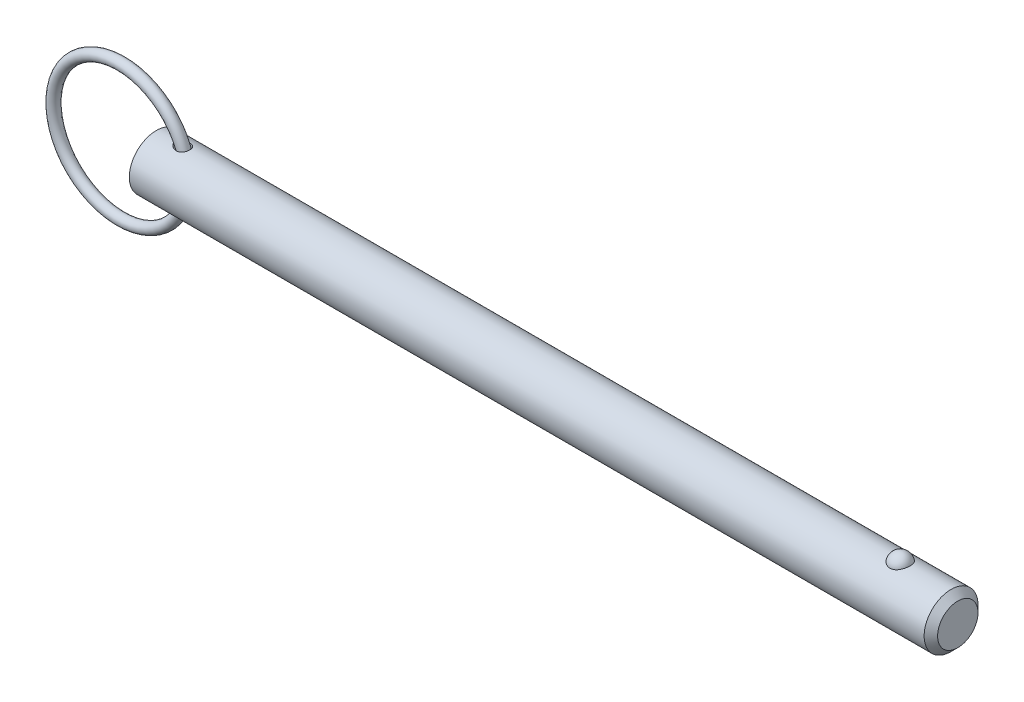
ISO-10303-21;
HEADER;
FILE_DESCRIPTION(('STEP AP214'),'2;1');
FILE_NAME('part.step','',(''),(''),'','','');
FILE_SCHEMA(('AUTOMOTIVE_DESIGN { 1 0 10303 214 1 1 1 1 }'));
ENDSEC;
DATA;
#1=APPLICATION_CONTEXT('core data for automotive mechanical design processes');
#2=APPLICATION_PROTOCOL_DEFINITION('international standard','automotive_design',2000,#1);
#3=PRODUCT_CONTEXT('',#1,'mechanical');
#4=PRODUCT('Part','Part','',(#3));
#5=PRODUCT_RELATED_PRODUCT_CATEGORY('part','',(#4));
#6=PRODUCT_DEFINITION_FORMATION('','',#4);
#7=PRODUCT_DEFINITION_CONTEXT('part definition',#1,'design');
#8=PRODUCT_DEFINITION('design','',#6,#7);
#9=PRODUCT_DEFINITION_SHAPE('','',#8);
#10=(LENGTH_UNIT() NAMED_UNIT(*) SI_UNIT(.MILLI.,.METRE.));
#11=(NAMED_UNIT(*) PLANE_ANGLE_UNIT() SI_UNIT($,.RADIAN.));
#12=(NAMED_UNIT(*) SI_UNIT($,.STERADIAN.) SOLID_ANGLE_UNIT());
#13=UNCERTAINTY_MEASURE_WITH_UNIT(LENGTH_MEASURE(1.E-05),#10,'distance_accuracy_value','');
#14=(GEOMETRIC_REPRESENTATION_CONTEXT(3) GLOBAL_UNCERTAINTY_ASSIGNED_CONTEXT((#13)) GLOBAL_UNIT_ASSIGNED_CONTEXT((#10,
#11,#12)) REPRESENTATION_CONTEXT('',''));
#15=CARTESIAN_POINT('',(0.,0.,0.));
#16=DIRECTION('',(0.,0.,1.));
#17=DIRECTION('',(1.,0.,0.));
#18=AXIS2_PLACEMENT_3D('',#15,#16,#17);
#19=CARTESIAN_POINT('',(-8.34703434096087,0.,0.));
#20=DIRECTION('',(0.,0.,1.));
#21=DIRECTION('',(1.,0.,0.));
#22=AXIS2_PLACEMENT_3D('',#19,#20,#21);
#23=TOROIDAL_SURFACE('',#22,15.875,1.27);
#24=CARTESIAN_POINT('',(8.79796565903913,0.,0.));
#25=VERTEX_POINT('',#24);
#26=VERTEX_LOOP('',#25);
#27=FACE_BOUND('',#26,.T.);
#28=ADVANCED_FACE('P0_F12',(#27),#23,.T.);
#29=CLOSED_SHELL('',(#28));
#30=MANIFOLD_SOLID_BREP('P0_B1',#29);
#31=CARTESIAN_POINT('',(0.,0.,0.));
#32=DIRECTION('',(1.,0.,0.));
#33=DIRECTION('',(0.,0.,-1.));
#34=AXIS2_PLACEMENT_3D('',#31,#32,#33);
#35=CYLINDRICAL_SURFACE('',#34,6.35);
#36=CARTESIAN_POINT('',(4.87230670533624,6.27273159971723,-0.987592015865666));
#37=CARTESIAN_POINT('',(4.94734735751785,6.26035058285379,-1.06623378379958));
#38=CARTESIAN_POINT('',(5.02968768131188,6.24755813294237,-1.13788608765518));
#39=CARTESIAN_POINT('',(5.20534267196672,6.22278258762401,-1.26640223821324));
#40=CARTESIAN_POINT('',(5.29867273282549,6.21080066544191,-1.32324497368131));
#41=CARTESIAN_POINT('',(5.49318962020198,6.18912414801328,-1.42117930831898));
#42=CARTESIAN_POINT('',(5.59435470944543,6.17942350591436,-1.46231273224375));
#43=CARTESIAN_POINT('',(5.80219659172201,6.16352555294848,-1.52793951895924));
#44=CARTESIAN_POINT('',(5.90887152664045,6.15732706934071,-1.55243845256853));
#45=CARTESIAN_POINT('',(6.12818220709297,6.14931784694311,-1.58387975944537));
#46=CARTESIAN_POINT('',(6.24090110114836,6.14763959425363,-1.59029227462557));
#47=CARTESIAN_POINT('',(6.46560233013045,6.14965588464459,-1.58248630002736));
#48=CARTESIAN_POINT('',(6.57758514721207,6.15334646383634,-1.56828303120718));
#49=CARTESIAN_POINT('',(6.78516594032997,6.1652116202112,-1.52091398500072));
#50=CARTESIAN_POINT('',(6.88126802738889,6.17288876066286,-1.48983713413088));
#51=CARTESIAN_POINT('',(7.06576629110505,6.19149190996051,-1.41052329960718));
#52=CARTESIAN_POINT('',(7.15416739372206,6.20241582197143,-1.36229738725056));
#53=CARTESIAN_POINT('',(7.3116692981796,6.2248616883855,-1.25548983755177));
#54=CARTESIAN_POINT('',(7.38181442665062,6.23621734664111,-1.19840625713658));
#55=CARTESIAN_POINT('',(7.51101296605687,6.259037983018,-1.07284763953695));
#56=CARTESIAN_POINT('',(7.5700684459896,6.2705029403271,-1.00437473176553));
#57=CARTESIAN_POINT('',(7.67374693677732,6.29184873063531,-0.860384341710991));
#58=CARTESIAN_POINT('',(7.71876694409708,6.30176816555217,-0.785157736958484));
#59=CARTESIAN_POINT('',(7.79574491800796,6.31935829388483,-0.628053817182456));
#60=CARTESIAN_POINT('',(7.82770308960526,6.32702902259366,-0.546176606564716));
#61=CARTESIAN_POINT('',(7.87788845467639,6.33930929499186,-0.377876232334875));
#62=CARTESIAN_POINT('',(7.8960810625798,6.34391112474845,-0.291442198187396));
#63=CARTESIAN_POINT('',(7.91820729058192,6.34953044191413,-0.116652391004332));
#64=CARTESIAN_POINT('',(7.92214044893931,6.35054781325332,-0.0282965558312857));
#65=CARTESIAN_POINT('',(7.91564686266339,6.34888556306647,0.14826357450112));
#66=CARTESIAN_POINT('',(7.9051533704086,6.34618875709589,0.236465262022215));
#67=CARTESIAN_POINT('',(7.86991530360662,6.33735741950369,0.409798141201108));
#68=CARTESIAN_POINT('',(7.84517062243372,6.33122286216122,0.494929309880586));
#69=CARTESIAN_POINT('',(7.78199851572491,6.31618517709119,0.659657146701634));
#70=CARTESIAN_POINT('',(7.74357645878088,6.30728313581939,0.739255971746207));
#71=CARTESIAN_POINT('',(7.65396632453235,6.28769050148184,0.890663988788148));
#72=CARTESIAN_POINT('',(7.60277911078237,6.27700002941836,0.962473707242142));
#73=CARTESIAN_POINT('',(7.48925881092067,6.2550822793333,1.09590260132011));
#74=CARTESIAN_POINT('',(7.42698604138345,6.24385813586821,1.15757361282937));
#75=CARTESIAN_POINT('',(7.29283556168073,6.2220655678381,1.26951234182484));
#76=CARTESIAN_POINT('',(7.22095880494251,6.21149707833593,1.31978118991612));
#77=CARTESIAN_POINT('',(7.06971853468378,6.19216002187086,1.40772509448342));
#78=CARTESIAN_POINT('',(6.99035873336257,6.18339056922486,1.44540635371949));
#79=CARTESIAN_POINT('',(6.826427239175,6.16851603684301,1.50762653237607));
#80=CARTESIAN_POINT('',(6.74185489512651,6.16241129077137,1.53216380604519));
#81=CARTESIAN_POINT('',(6.56686412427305,6.15321474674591,1.56869994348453));
#82=CARTESIAN_POINT('',(6.47634467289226,6.15023369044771,1.58023897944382));
#83=CARTESIAN_POINT('',(6.29456956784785,6.14778331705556,1.58974172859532));
#84=CARTESIAN_POINT('',(6.20331368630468,6.1483151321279,1.58770106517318));
#85=CARTESIAN_POINT('',(6.01385969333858,6.15284811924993,1.5700487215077));
#86=CARTESIAN_POINT('',(5.91578322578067,6.15715979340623,1.55322212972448));
#87=CARTESIAN_POINT('',(5.72331909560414,6.16902415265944,1.5054032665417));
#88=CARTESIAN_POINT('',(5.62893440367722,6.17657939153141,1.4743998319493));
#89=CARTESIAN_POINT('',(5.43572606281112,6.19502494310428,1.39499475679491));
#90=CARTESIAN_POINT('',(5.33755891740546,6.20619097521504,1.3450526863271));
#91=CARTESIAN_POINT('',(5.15090047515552,6.23006191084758,1.22975103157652));
#92=CARTESIAN_POINT('',(5.06240741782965,6.24276653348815,1.16439425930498));
#93=CARTESIAN_POINT('',(4.91171642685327,6.26607433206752,1.03083814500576));
#94=CARTESIAN_POINT('',(4.84758224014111,6.27668356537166,0.964825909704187));
#95=CARTESIAN_POINT('',(4.73090054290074,6.29683133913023,0.823112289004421));
#96=CARTESIAN_POINT('',(4.6783368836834,6.30637136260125,0.747424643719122));
#97=CARTESIAN_POINT('',(4.59543145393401,6.32183254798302,0.601150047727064));
#98=CARTESIAN_POINT('',(4.56283099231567,6.32809321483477,0.531883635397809));
#99=CARTESIAN_POINT('',(4.50941370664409,6.33849198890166,0.388778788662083));
#100=CARTESIAN_POINT('',(4.48858876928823,6.34263155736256,0.314943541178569));
#101=CARTESIAN_POINT('',(4.46008864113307,6.3483236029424,0.164282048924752));
#102=CARTESIAN_POINT('',(4.45247558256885,6.34986385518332,0.0874434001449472));
#103=CARTESIAN_POINT('',(4.45121096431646,6.35011863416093,-0.0663538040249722));
#104=CARTESIAN_POINT('',(4.45755802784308,6.34883343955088,-0.143312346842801));
#105=CARTESIAN_POINT('',(4.48267656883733,6.34380948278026,-0.288945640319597));
#106=CARTESIAN_POINT('',(4.50045680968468,6.34026665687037,-0.357802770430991));
#107=CARTESIAN_POINT('',(4.54636050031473,6.33128211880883,-0.49181574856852));
#108=CARTESIAN_POINT('',(4.57448566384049,6.32584009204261,-0.556970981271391));
#109=CARTESIAN_POINT('',(4.64209700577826,6.31308107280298,-0.687092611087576));
#110=CARTESIAN_POINT('',(4.68226903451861,6.30565525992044,-0.75168940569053));
#111=CARTESIAN_POINT('',(4.77120834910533,6.28979741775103,-0.874524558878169));
#112=CARTESIAN_POINT('',(4.81998302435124,6.28136452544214,-0.932757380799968));
#113=CARTESIAN_POINT('',(4.87230670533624,6.27273159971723,-0.987592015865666));
#114=B_SPLINE_CURVE_WITH_KNOTS('',3,(#36,#37,#38,#39,#40,#41,#42,#43,#44,#45,#46,#47,#48,#49,
#50,#51,#52,#53,#54,#55,#56,#57,#58,#59,#60,#61,#62,#63,#64,#65,#66,#67,#68,#69,#70,#71,#72,#73,
#74,#75,#76,#77,#78,#79,#80,#81,#82,#83,#84,#85,#86,#87,#88,#89,#90,#91,#92,#93,#94,#95,#96,#97,
#98,#99,#100,#101,#102,#103,#104,#105,#106,#107,#108,#109,#110,#111,#112,#113),.UNSPECIFIED.,
.T.,.F.,(4,2,2,2,2,2,2,2,2,2,2,2,2,2,2,2,2,2,2,2,2,2,2,2,2,2,2,2,2,2,2,2,2,2,2,2,2,2,4),(0.,
0.327902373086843,0.65626964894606,0.98375647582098,1.31113357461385,1.64800657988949,
1.98463099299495,2.28681225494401,2.58879878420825,2.86088594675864,3.13292229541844,
3.39636481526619,3.65980320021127,3.92390128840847,4.18800792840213,4.45334062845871,
4.7186753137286,4.98390596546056,5.24911867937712,5.51293017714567,5.7767155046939,
6.04037065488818,6.30405880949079,6.57680801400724,6.84964512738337,7.14724526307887,
7.44508014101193,7.77572668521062,8.10631295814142,8.38318772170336,8.65967357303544,
8.8891530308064,9.11847418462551,9.34887088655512,9.57924486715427,9.79193291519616,
10.0046562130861,10.2330958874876,10.4617327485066),.UNSPECIFIED.);
#115=CARTESIAN_POINT('',(4.87230670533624,6.27273159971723,-0.987592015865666));
#116=VERTEX_POINT('',#115);
#117=EDGE_CURVE('P1_E40',#116,#116,#114,.T.);
#118=ORIENTED_EDGE('',*,*,#117,.T.);
#119=EDGE_LOOP('',(#118));
#120=FACE_BOUND('',#119,.T.);
#121=CARTESIAN_POINT('',(187.3125,0.,0.));
#122=DIRECTION('',(1.,0.,0.));
#123=DIRECTION('',(0.,0.,-1.));
#124=AXIS2_PLACEMENT_3D('',#121,#122,#123);
#125=CIRCLE('',#124,6.35);
#126=CARTESIAN_POINT('',(187.3125,0.,-6.35));
#127=VERTEX_POINT('',#126);
#128=EDGE_CURVE('P1_E25',#127,#127,#125,.T.);
#129=ORIENTED_EDGE('',*,*,#128,.F.);
#130=EDGE_LOOP('',(#129));
#131=FACE_BOUND('',#130,.T.);
#132=CARTESIAN_POINT('',(0.,0.,0.));
#133=DIRECTION('',(1.,0.,0.));
#134=DIRECTION('',(0.,0.,-1.));
#135=AXIS2_PLACEMENT_3D('',#132,#133,#134);
#136=CIRCLE('',#135,6.35);
#137=CARTESIAN_POINT('',(0.,0.,-6.35));
#138=VERTEX_POINT('',#137);
#139=EDGE_CURVE('P1_E9',#138,#138,#136,.T.);
#140=ORIENTED_EDGE('',*,*,#139,.T.);
#141=EDGE_LOOP('',(#140));
#142=FACE_BOUND('',#141,.T.);
#143=CARTESIAN_POINT('',(175.350021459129,5.87502187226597,2.40969251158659));
#144=CARTESIAN_POINT('',(175.225030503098,5.87501645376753,2.40969773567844));
#145=CARTESIAN_POINT('',(175.100080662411,5.87916061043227,2.39967292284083));
#146=CARTESIAN_POINT('',(174.853909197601,5.8952311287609,2.35991730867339));
#147=CARTESIAN_POINT('',(174.732686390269,5.90715499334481,2.33019283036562));
#148=CARTESIAN_POINT('',(174.497517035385,5.93739567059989,2.25201402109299));
#149=CARTESIAN_POINT('',(174.383560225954,5.95570321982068,2.20358681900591));
#150=CARTESIAN_POINT('',(174.16557352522,5.99672067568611,2.08937987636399));
#151=CARTESIAN_POINT('',(174.061545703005,6.01943149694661,2.02359652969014));
#152=CARTESIAN_POINT('',(173.862943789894,6.06760647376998,1.87428969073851));
#153=CARTESIAN_POINT('',(173.768726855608,6.09313095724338,1.79031110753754));
#154=CARTESIAN_POINT('',(173.595255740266,6.14375873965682,1.60800178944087));
#155=CARTESIAN_POINT('',(173.516004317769,6.16886196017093,1.50966841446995));
#156=CARTESIAN_POINT('',(173.370845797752,6.21724600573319,1.29645884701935));
#157=CARTESIAN_POINT('',(173.305688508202,6.24039621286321,1.18104158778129));
#158=CARTESIAN_POINT('',(173.194703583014,6.28117277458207,0.940351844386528));
#159=CARTESIAN_POINT('',(173.148877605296,6.29879865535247,0.815078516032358));
#160=CARTESIAN_POINT('',(173.077023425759,6.32692073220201,0.55649439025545));
#161=CARTESIAN_POINT('',(173.051249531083,6.33732517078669,0.42310277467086));
#162=CARTESIAN_POINT('',(173.020988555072,6.34957673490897,0.153542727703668));
#163=CARTESIAN_POINT('',(173.016500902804,6.35142408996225,0.0173743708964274));
#164=CARTESIAN_POINT('',(173.028865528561,6.34638925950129,-0.253036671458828));
#165=CARTESIAN_POINT('',(173.045594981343,6.33955731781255,-0.387285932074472));
#166=CARTESIAN_POINT('',(173.099843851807,6.31794129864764,-0.650851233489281));
#167=CARTESIAN_POINT('',(173.137363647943,6.30315707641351,-0.7801671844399));
#168=CARTESIAN_POINT('',(173.232500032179,6.26711642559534,-1.03041949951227));
#169=CARTESIAN_POINT('',(173.290143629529,6.24585130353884,-1.1513443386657));
#170=CARTESIAN_POINT('',(173.424352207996,6.19905619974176,-1.38129800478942));
#171=CARTESIAN_POINT('',(173.500918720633,6.17352587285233,-1.49032586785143));
#172=CARTESIAN_POINT('',(173.671753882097,6.12080227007,-1.69393164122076));
#173=CARTESIAN_POINT('',(173.766100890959,6.09360200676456,-1.78844209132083));
#174=CARTESIAN_POINT('',(173.970119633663,6.04070434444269,-1.95970536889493));
#175=CARTESIAN_POINT('',(174.079790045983,6.01500681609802,-2.03645972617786));
#176=CARTESIAN_POINT('',(174.309187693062,5.96867714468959,-2.1684564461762));
#177=CARTESIAN_POINT('',(174.428652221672,5.94794910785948,-2.2241206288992));
#178=CARTESIAN_POINT('',(174.676218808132,5.91340580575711,-2.31440992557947));
#179=CARTESIAN_POINT('',(174.804317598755,5.8995879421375,-2.3490429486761));
#180=CARTESIAN_POINT('',(175.058582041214,5.88111049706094,-2.39491590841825));
#181=CARTESIAN_POINT('',(175.184520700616,5.876025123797,-2.40724512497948));
#182=CARTESIAN_POINT('',(175.436786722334,5.87428980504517,-2.41147867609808));
#183=CARTESIAN_POINT('',(175.563114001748,5.87763817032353,-2.40338710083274));
#184=CARTESIAN_POINT('',(175.808417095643,5.89212921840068,-2.36762715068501));
#185=CARTESIAN_POINT('',(175.927499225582,5.90302431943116,-2.34058030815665));
#186=CARTESIAN_POINT('',(176.15924472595,5.93113752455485,-2.26839066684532));
#187=CARTESIAN_POINT('',(176.271907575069,5.94835614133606,-2.22324640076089));
#188=CARTESIAN_POINT('',(176.490400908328,5.98773016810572,-2.11493806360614));
#189=CARTESIAN_POINT('',(176.596028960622,6.00998499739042,-2.05140269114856));
#190=CARTESIAN_POINT('',(176.795300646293,6.05690144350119,-1.90842705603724));
#191=CARTESIAN_POINT('',(176.888941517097,6.08156361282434,-1.82898313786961));
#192=CARTESIAN_POINT('',(177.066675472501,6.13211715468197,-1.65182429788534));
#193=CARTESIAN_POINT('',(177.150055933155,6.15800825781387,-1.55339381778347));
#194=CARTESIAN_POINT('',(177.299790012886,6.20712834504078,-1.34374214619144));
#195=CARTESIAN_POINT('',(177.366140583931,6.23035685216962,-1.23251867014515));
#196=CARTESIAN_POINT('',(177.482345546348,6.27251177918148,-0.996447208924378));
#197=CARTESIAN_POINT('',(177.531607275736,6.29127762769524,-0.871278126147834));
#198=CARTESIAN_POINT('',(177.609614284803,6.3215862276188,-0.613870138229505));
#199=CARTESIAN_POINT('',(177.638359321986,6.33312889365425,-0.481631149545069));
#200=CARTESIAN_POINT('',(177.67477058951,6.34782349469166,-0.213672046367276));
#201=CARTESIAN_POINT('',(177.682413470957,6.35096613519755,-0.0779482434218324));
#202=CARTESIAN_POINT('',(177.676395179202,6.34851322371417,0.192943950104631));
#203=CARTESIAN_POINT('',(177.662734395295,6.3429178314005,0.328112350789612));
#204=CARTESIAN_POINT('',(177.61450361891,6.32360512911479,0.593406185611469));
#205=CARTESIAN_POINT('',(177.580031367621,6.30992579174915,0.723552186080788));
#206=CARTESIAN_POINT('',(177.490953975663,6.27586325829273,0.975834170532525));
#207=CARTESIAN_POINT('',(177.43634761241,6.25547965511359,1.0979696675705));
#208=CARTESIAN_POINT('',(177.30775879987,6.20998183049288,1.33148921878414));
#209=CARTESIAN_POINT('',(177.233674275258,6.18484288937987,1.44281227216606));
#210=CARTESIAN_POINT('',(177.067820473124,6.13258735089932,1.65087683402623));
#211=CARTESIAN_POINT('',(176.976051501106,6.10547078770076,1.74761859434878));
#212=CARTESIAN_POINT('',(176.777183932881,6.05235879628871,1.92350926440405));
#213=CARTESIAN_POINT('',(176.670133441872,6.02636017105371,2.00271146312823));
#214=CARTESIAN_POINT('',(176.443138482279,5.97843747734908,2.1415415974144));
#215=CARTESIAN_POINT('',(176.323191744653,5.95651412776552,2.20116608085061));
#216=CARTESIAN_POINT('',(176.064523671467,5.91812106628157,2.30250570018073));
#217=CARTESIAN_POINT('',(175.92506980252,5.90217533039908,2.34256795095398));
#218=CARTESIAN_POINT('',(175.640397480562,5.88063128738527,2.39615214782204));
#219=CARTESIAN_POINT('',(175.49518174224,5.8750281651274,2.40968644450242));
#220=CARTESIAN_POINT('',(175.350021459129,5.87502187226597,2.40969251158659));
#221=B_SPLINE_CURVE_WITH_KNOTS('',3,(#143,#144,#145,#146,#147,#148,#149,#150,#151,#152,#153,
#154,#155,#156,#157,#158,#159,#160,#161,#162,#163,#164,#165,#166,#167,#168,#169,#170,#171,#172,
#173,#174,#175,#176,#177,#178,#179,#180,#181,#182,#183,#184,#185,#186,#187,#188,#189,#190,#191,
#192,#193,#194,#195,#196,#197,#198,#199,#200,#201,#202,#203,#204,#205,#206,#207,#208,#209,#210,
#211,#212,#213,#214,#215,#216,#217,#218,#219,#220),.UNSPECIFIED.,.T.,.F.,(4,2,2,2,2,2,2,2,2,2,2,
2,2,2,2,2,2,2,2,2,2,2,2,2,2,2,2,2,2,2,2,2,2,2,2,2,2,2,4),(0.,0.374440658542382,
0.748761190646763,1.12254078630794,1.49639810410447,1.88098871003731,2.2656501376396,
2.6674110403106,3.06920639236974,3.47601794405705,3.88281858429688,4.28727498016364,
4.69173873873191,5.09674745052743,5.50178895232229,5.9086591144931,6.31549420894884,
6.71369855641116,7.11175305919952,7.48978077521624,7.86773278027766,8.2338388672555,
8.59997464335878,8.97409044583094,9.34829231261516,9.74122667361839,10.1342313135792,
10.5397522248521,10.9452779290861,11.3512521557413,11.7572189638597,12.1612938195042,
12.5653932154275,12.9716540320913,13.3779078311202,13.7829098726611,14.1879832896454,
14.6230486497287,15.0579114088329),.UNSPECIFIED.);
#222=CARTESIAN_POINT('',(175.350021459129,5.87502187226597,2.40969251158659));
#223=VERTEX_POINT('',#222);
#224=EDGE_CURVE('P1_E34',#223,#223,#221,.T.);
#225=ORIENTED_EDGE('',*,*,#224,.T.);
#226=EDGE_LOOP('',(#225));
#227=FACE_BOUND('',#226,.T.);
#228=CARTESIAN_POINT('',(4.87230670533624,-6.27273159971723,-0.987592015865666));
#229=CARTESIAN_POINT('',(4.81440819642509,-6.28228431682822,-0.926913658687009));
#230=CARTESIAN_POINT('',(4.76085022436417,-6.29159289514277,-0.862071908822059));
#231=CARTESIAN_POINT('',(4.66448472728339,-6.3088950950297,-0.724655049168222));
#232=CARTESIAN_POINT('',(4.62166818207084,-6.31688981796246,-0.652086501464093));
#233=CARTESIAN_POINT('',(4.54882773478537,-6.33076917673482,-0.499747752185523));
#234=CARTESIAN_POINT('',(4.51891553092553,-6.33663532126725,-0.419921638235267));
#235=CARTESIAN_POINT('',(4.4747692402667,-6.3453711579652,-0.255882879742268));
#236=CARTESIAN_POINT('',(4.4605188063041,-6.34824397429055,-0.171674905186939));
#237=CARTESIAN_POINT('',(4.44966179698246,-6.35043041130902,-0.012076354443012));
#238=CARTESIAN_POINT('',(4.45117530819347,-6.35012328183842,0.063184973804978));
#239=CARTESIAN_POINT('',(4.46726452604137,-6.34689000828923,0.212230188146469));
#240=CARTESIAN_POINT('',(4.48184026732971,-6.3439638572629,0.286014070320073));
#241=CARTESIAN_POINT('',(4.52202068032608,-6.33603071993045,0.426550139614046));
#242=CARTESIAN_POINT('',(4.54707079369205,-6.33112875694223,0.493469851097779));
#243=CARTESIAN_POINT('',(4.60669855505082,-6.31972370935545,0.622743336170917));
#244=CARTESIAN_POINT('',(4.64127887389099,-6.31322017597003,0.685095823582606));
#245=CARTESIAN_POINT('',(4.7232814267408,-6.29826068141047,0.811769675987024));
#246=CARTESIAN_POINT('',(4.77176118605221,-6.28966287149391,0.87538636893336));
#247=CARTESIAN_POINT('',(4.87703902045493,-6.27182325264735,0.995192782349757));
#248=CARTESIAN_POINT('',(4.93384225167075,-6.26258104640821,1.05137785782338));
#249=CARTESIAN_POINT('',(5.06617436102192,-6.24228878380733,1.16635591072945));
#250=CARTESIAN_POINT('',(5.14318167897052,-6.23124423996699,1.22345054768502));
#251=CARTESIAN_POINT('',(5.3047576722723,-6.21023402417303,1.32598441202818));
#252=CARTESIAN_POINT('',(5.38933237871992,-6.20026922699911,1.37141422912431));
#253=CARTESIAN_POINT('',(5.57760134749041,-6.18099350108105,1.45601817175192));
#254=CARTESIAN_POINT('',(5.68224348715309,-6.17201456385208,1.4931788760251));
#255=CARTESIAN_POINT('',(5.89649087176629,-6.15800474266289,1.5499484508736));
#256=CARTESIAN_POINT('',(6.00609708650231,-6.15297463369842,1.56955387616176));
#257=CARTESIAN_POINT('',(6.22752772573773,-6.14779725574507,1.58971993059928));
#258=CARTESIAN_POINT('',(6.33935715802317,-6.14766266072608,1.59023112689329));
#259=CARTESIAN_POINT('',(6.56108231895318,-6.15269227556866,1.57066564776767));
#260=CARTESIAN_POINT('',(6.67097982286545,-6.15785133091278,1.55060899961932));
#261=CARTESIAN_POINT('',(6.87257705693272,-6.17211580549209,1.4927326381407));
#262=CARTESIAN_POINT('',(6.96494608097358,-6.18072242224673,1.45711948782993));
#263=CARTESIAN_POINT('',(7.14129343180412,-6.20069920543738,1.36960980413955));
#264=CARTESIAN_POINT('',(7.22527609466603,-6.21206793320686,1.31772174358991));
#265=CARTESIAN_POINT('',(7.37471505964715,-6.23497047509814,1.20443359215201));
#266=CARTESIAN_POINT('',(7.44115811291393,-6.24639757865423,1.14430788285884));
#267=CARTESIAN_POINT('',(7.56261868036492,-6.26896339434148,1.0134084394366));
#268=CARTESIAN_POINT('',(7.61763801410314,-6.28010215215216,0.942636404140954));
#269=CARTESIAN_POINT('',(7.71360563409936,-6.30055923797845,0.794304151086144));
#270=CARTESIAN_POINT('',(7.75485562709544,-6.3099143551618,0.716943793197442));
#271=CARTESIAN_POINT('',(7.82406051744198,-6.32610528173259,0.556244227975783));
#272=CARTESIAN_POINT('',(7.85201540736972,-6.33294108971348,0.472905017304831));
#273=CARTESIAN_POINT('',(7.89408663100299,-6.34338077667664,0.302249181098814));
#274=CARTESIAN_POINT('',(7.90814615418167,-6.34697138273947,0.214917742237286));
#275=CARTESIAN_POINT('',(7.92192329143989,-6.35048887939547,0.0390564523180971));
#276=CARTESIAN_POINT('',(7.92164046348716,-6.3504156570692,-0.0494734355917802));
#277=CARTESIAN_POINT('',(7.9067075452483,-6.34660520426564,-0.225592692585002));
#278=CARTESIAN_POINT('',(7.89199989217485,-6.34285329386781,-0.313176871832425));
#279=CARTESIAN_POINT('',(7.84845340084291,-6.33206809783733,-0.484549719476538));
#280=CARTESIAN_POINT('',(7.8196145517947,-6.32503480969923,-0.568338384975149));
#281=CARTESIAN_POINT('',(7.74850591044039,-6.30846389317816,-0.729625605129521));
#282=CARTESIAN_POINT('',(7.70625193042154,-6.29892921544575,-0.807131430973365));
#283=CARTESIAN_POINT('',(7.60933437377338,-6.27840608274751,-0.953731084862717));
#284=CARTESIAN_POINT('',(7.55467181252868,-6.2674177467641,-1.02282560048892));
#285=CARTESIAN_POINT('',(7.43471786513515,-6.24527869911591,-1.15028913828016));
#286=CARTESIAN_POINT('',(7.36948829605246,-6.23412925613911,-1.20871657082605));
#287=CARTESIAN_POINT('',(7.23001723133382,-6.21283678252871,-1.3137894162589));
#288=CARTESIAN_POINT('',(7.15577649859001,-6.20269366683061,-1.36043582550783));
#289=CARTESIAN_POINT('',(7.00025986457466,-6.18446636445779,-1.44103993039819));
#290=CARTESIAN_POINT('',(6.91896776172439,-6.17638709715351,-1.47496739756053));
#291=CARTESIAN_POINT('',(6.75184232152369,-6.16309237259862,-1.52957024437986));
#292=CARTESIAN_POINT('',(6.6660081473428,-6.15787744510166,-1.55024317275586));
#293=CARTESIAN_POINT('',(6.48842585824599,-6.15055064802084,-1.57906962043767));
#294=CARTESIAN_POINT('',(6.39658108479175,-6.14857915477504,-1.58665744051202));
#295=CARTESIAN_POINT('',(6.21279832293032,-6.14817707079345,-1.58821048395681));
#296=CARTESIAN_POINT('',(6.12086031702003,-6.14974736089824,-1.58217231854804));
#297=CARTESIAN_POINT('',(5.92996902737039,-6.15640095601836,-1.55609403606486));
#298=CARTESIAN_POINT('',(5.83120653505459,-6.16181208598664,-1.53474519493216));
#299=CARTESIAN_POINT('',(5.63804881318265,-6.17573474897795,-1.47771859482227));
#300=CARTESIAN_POINT('',(5.54365953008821,-6.18425037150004,-1.44202192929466));
#301=CARTESIAN_POINT('',(5.34413923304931,-6.20522938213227,-1.34918979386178));
#302=CARTESIAN_POINT('',(5.24033140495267,-6.21813417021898,-1.28928337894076));
#303=CARTESIAN_POINT('',(5.0455423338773,-6.24510162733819,-1.15156760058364));
#304=CARTESIAN_POINT('',(4.95454590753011,-6.25916289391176,-1.07377972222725));
#305=CARTESIAN_POINT('',(4.87230670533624,-6.27273159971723,-0.987592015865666));
#306=B_SPLINE_CURVE_WITH_KNOTS('',3,(#228,#229,#230,#231,#232,#233,#234,#235,#236,#237,#238,
#239,#240,#241,#242,#243,#244,#245,#246,#247,#248,#249,#250,#251,#252,#253,#254,#255,#256,#257,
#258,#259,#260,#261,#262,#263,#264,#265,#266,#267,#268,#269,#270,#271,#272,#273,#274,#275,#276,
#277,#278,#279,#280,#281,#282,#283,#284,#285,#286,#287,#288,#289,#290,#291,#292,#293,#294,#295,
#296,#297,#298,#299,#300,#301,#302,#303,#304,#305),.UNSPECIFIED.,.T.,.F.,(4,2,2,2,2,2,2,2,2,2,2,
2,2,2,2,2,2,2,2,2,2,2,2,2,2,2,2,2,2,2,2,2,2,2,2,2,2,2,4),(0.,0.252951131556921,0.50568912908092,
0.760572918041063,1.01519041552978,1.23982791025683,1.46446600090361,1.67847364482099,
1.89254132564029,2.13299551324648,2.37359928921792,2.6619896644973,2.95061196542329,
3.28329078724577,3.61603488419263,3.94964035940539,4.282921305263,4.57939201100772,
4.87570862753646,5.14538810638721,5.4150245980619,5.67829123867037,5.94155802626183,
6.20589676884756,6.47024365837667,6.73564974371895,7.00105603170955,7.26615064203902,
7.53122356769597,7.79479837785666,8.05835088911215,8.32252586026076,8.58674967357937,
8.86213419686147,9.137587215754,9.43991696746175,9.74264642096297,10.1023688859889,
10.461661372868),.UNSPECIFIED.);
#307=CARTESIAN_POINT('',(4.87230670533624,-6.27273159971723,-0.987592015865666));
#308=VERTEX_POINT('',#307);
#309=EDGE_CURVE('P1_E17',#308,#308,#306,.T.);
#310=ORIENTED_EDGE('',*,*,#309,.T.);
#311=EDGE_LOOP('',(#310));
#312=FACE_BOUND('',#311,.T.);
#313=ADVANCED_FACE('P1_F13',(#120,#131,#142,#227,#312),#35,.T.);
#314=CARTESIAN_POINT('',(0.,0.,0.));
#315=DIRECTION('',(-1.,0.,0.));
#316=DIRECTION('',(0.,0.,1.));
#317=AXIS2_PLACEMENT_3D('',#314,#315,#316);
#318=PLANE('',#317);
#319=ORIENTED_EDGE('',*,*,#139,.F.);
#320=EDGE_LOOP('',(#319));
#321=FACE_BOUND('',#320,.T.);
#322=ADVANCED_FACE('P1_F15',(#321),#318,.T.);
#323=CARTESIAN_POINT('',(188.9,0.,0.));
#324=DIRECTION('',(-1.,0.,0.));
#325=DIRECTION('',(0.,0.,1.));
#326=AXIS2_PLACEMENT_3D('',#323,#324,#325);
#327=CONICAL_SURFACE('',#326,4.76250000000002,0.785398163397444);
#328=ORIENTED_EDGE('',*,*,#128,.T.);
#329=EDGE_LOOP('',(#328));
#330=FACE_BOUND('',#329,.T.);
#331=CARTESIAN_POINT('',(188.9,0.,0.));
#332=DIRECTION('',(1.,0.,0.));
#333=DIRECTION('',(0.,0.,-1.));
#334=AXIS2_PLACEMENT_3D('',#331,#332,#333);
#335=CIRCLE('',#334,4.76250000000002);
#336=CARTESIAN_POINT('',(188.9,0.,-4.76250000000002));
#337=VERTEX_POINT('',#336);
#338=EDGE_CURVE('P1_E30',#337,#337,#335,.T.);
#339=ORIENTED_EDGE('',*,*,#338,.F.);
#340=EDGE_LOOP('',(#339));
#341=FACE_BOUND('',#340,.T.);
#342=ADVANCED_FACE('P1_F55',(#330,#341),#327,.T.);
#343=CARTESIAN_POINT('',(188.9,4.76250000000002,0.));
#344=DIRECTION('',(1.,0.,0.));
#345=DIRECTION('',(0.,0.,-1.));
#346=AXIS2_PLACEMENT_3D('',#343,#344,#345);
#347=PLANE('',#346);
#348=ORIENTED_EDGE('',*,*,#338,.T.);
#349=EDGE_LOOP('',(#348));
#350=FACE_BOUND('',#349,.T.);
#351=ADVANCED_FACE('P1_F51',(#350),#347,.T.);
#352=CARTESIAN_POINT('',(175.350021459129,5.715,0.));
#353=DIRECTION('',(-1.,0.,0.));
#354=DIRECTION('',(0.,1.,0.));
#355=AXIS2_PLACEMENT_3D('',#352,#353,#354);
#356=SPHERICAL_SURFACE('',#355,2.415);
#357=ORIENTED_EDGE('',*,*,#224,.F.);
#358=EDGE_LOOP('',(#357));
#359=FACE_BOUND('',#358,.T.);
#360=ADVANCED_FACE('P1_F46',(#359),#356,.T.);
#361=CARTESIAN_POINT('',(-8.34703434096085,0.,0.));
#362=DIRECTION('',(0.,0.,1.));
#363=DIRECTION('',(1.,0.,0.));
#364=AXIS2_PLACEMENT_3D('',#361,#362,#363);
#365=TOROIDAL_SURFACE('',#364,15.875,1.5875);
#366=ORIENTED_EDGE('',*,*,#309,.F.);
#367=EDGE_LOOP('',(#366));
#368=FACE_BOUND('',#367,.T.);
#369=ORIENTED_EDGE('',*,*,#117,.F.);
#370=EDGE_LOOP('',(#369));
#371=FACE_BOUND('',#370,.T.);
#372=ADVANCED_FACE('P1_F50',(#368,#371),#365,.F.);
#373=CLOSED_SHELL('',(#313,#322,#342,#351,#360,#372));
#374=MANIFOLD_SOLID_BREP('P1_B1',#373);
#375=ADVANCED_BREP_SHAPE_REPRESENTATION('',(#18,#30,#374),#14);
#376=SHAPE_DEFINITION_REPRESENTATION(#9,#375);
ENDSEC;
END-ISO-10303-21;
